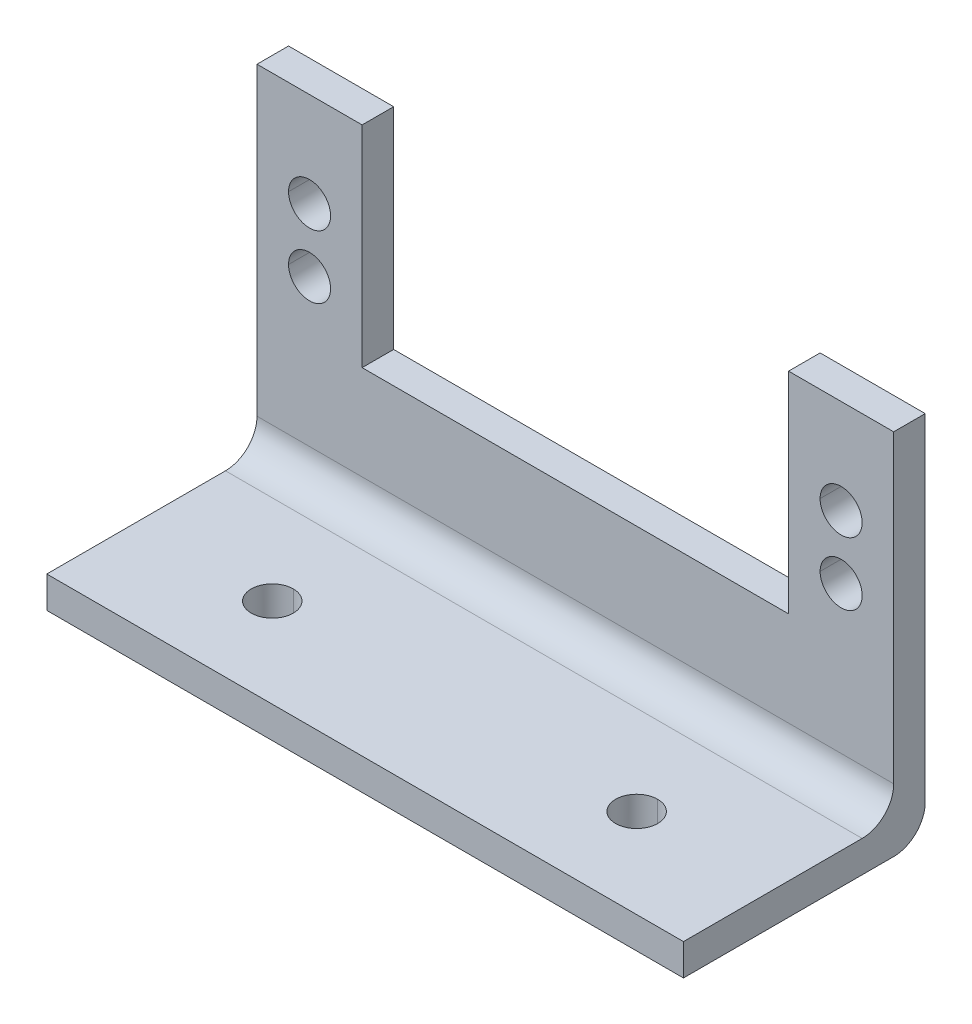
ISO-10303-21;
HEADER;
FILE_DESCRIPTION(('STEP AP214'),'2;1');
FILE_NAME('part.step','',(''),(''),'','','');
FILE_SCHEMA(('AUTOMOTIVE_DESIGN { 1 0 10303 214 1 1 1 1 }'));
ENDSEC;
DATA;
#1=APPLICATION_CONTEXT('core data for automotive mechanical design processes');
#2=APPLICATION_PROTOCOL_DEFINITION('international standard','automotive_design',2000,#1);
#3=PRODUCT_CONTEXT('',#1,'mechanical');
#4=PRODUCT('Part','Part','',(#3));
#5=PRODUCT_RELATED_PRODUCT_CATEGORY('part','',(#4));
#6=PRODUCT_DEFINITION_FORMATION('','',#4);
#7=PRODUCT_DEFINITION_CONTEXT('part definition',#1,'design');
#8=PRODUCT_DEFINITION('design','',#6,#7);
#9=PRODUCT_DEFINITION_SHAPE('','',#8);
#10=(LENGTH_UNIT() NAMED_UNIT(*) SI_UNIT(.MILLI.,.METRE.));
#11=(NAMED_UNIT(*) PLANE_ANGLE_UNIT() SI_UNIT($,.RADIAN.));
#12=(NAMED_UNIT(*) SI_UNIT($,.STERADIAN.) SOLID_ANGLE_UNIT());
#13=UNCERTAINTY_MEASURE_WITH_UNIT(LENGTH_MEASURE(1.E-05),#10,'distance_accuracy_value','');
#14=(GEOMETRIC_REPRESENTATION_CONTEXT(3) GLOBAL_UNCERTAINTY_ASSIGNED_CONTEXT((#13)) GLOBAL_UNIT_ASSIGNED_CONTEXT((#10,
#11,#12)) REPRESENTATION_CONTEXT('',''));
#15=CARTESIAN_POINT('',(0.,0.,0.));
#16=DIRECTION('',(0.,0.,1.));
#17=DIRECTION('',(1.,0.,0.));
#18=AXIS2_PLACEMENT_3D('',#15,#16,#17);
#19=CARTESIAN_POINT('',(30.285,-15.1838385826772,3.));
#20=DIRECTION('',(0.,0.,1.));
#21=DIRECTION('',(0.,1.,0.));
#22=AXIS2_PLACEMENT_3D('',#19,#20,#21);
#23=PLANE('',#22);
#24=CARTESIAN_POINT('',(-30.285,13.8161614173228,3.));
#25=DIRECTION('',(0.,-1.,0.));
#26=VECTOR('',#25,1.);
#27=LINE('',#24,#26);
#28=CARTESIAN_POINT('',(-30.285,13.8161614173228,3.));
#29=VERTEX_POINT('',#28);
#30=CARTESIAN_POINT('',(-30.285,-15.1838385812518,3.00003489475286));
#31=VERTEX_POINT('',#30);
#32=EDGE_CURVE('E11',#29,#31,#27,.T.);
#33=ORIENTED_EDGE('',*,*,#32,.T.);
#34=CARTESIAN_POINT('',(-30.285,-15.1838385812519,3.));
#35=DIRECTION('',(1.,-2.35320093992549E-11,0.));
#36=VECTOR('',#35,1.);
#37=LINE('',#34,#36);
#38=CARTESIAN_POINT('',(30.285,-15.1838385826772,3.));
#39=VERTEX_POINT('',#38);
#40=EDGE_CURVE('E24',#31,#39,#37,.T.);
#41=ORIENTED_EDGE('',*,*,#40,.T.);
#42=CARTESIAN_POINT('',(30.285,-15.1838385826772,3.));
#43=DIRECTION('',(0.,1.,0.));
#44=VECTOR('',#43,1.);
#45=LINE('',#42,#44);
#46=CARTESIAN_POINT('',(30.285,13.8161614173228,3.));
#47=VERTEX_POINT('',#46);
#48=EDGE_CURVE('E787',#39,#47,#45,.T.);
#49=ORIENTED_EDGE('',*,*,#48,.T.);
#50=CARTESIAN_POINT('',(30.285,13.8161614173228,3.));
#51=DIRECTION('',(-1.,0.,0.));
#52=VECTOR('',#51,1.);
#53=LINE('',#50,#52);
#54=CARTESIAN_POINT('',(20.285,13.8161614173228,3.));
#55=VERTEX_POINT('',#54);
#56=EDGE_CURVE('E785',#47,#55,#53,.T.);
#57=ORIENTED_EDGE('',*,*,#56,.T.);
#58=CARTESIAN_POINT('',(20.285,13.8161614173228,3.));
#59=DIRECTION('',(0.,-1.,0.));
#60=VECTOR('',#59,1.);
#61=LINE('',#58,#60);
#62=CARTESIAN_POINT('',(20.285,-6.18383858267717,3.));
#63=VERTEX_POINT('',#62);
#64=EDGE_CURVE('E782',#55,#63,#61,.T.);
#65=ORIENTED_EDGE('',*,*,#64,.T.);
#66=CARTESIAN_POINT('',(20.285,-6.18383858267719,3.));
#67=DIRECTION('',(-1.,0.,0.));
#68=VECTOR('',#67,1.);
#69=LINE('',#66,#68);
#70=CARTESIAN_POINT('',(-20.285,-6.18383858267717,3.));
#71=VERTEX_POINT('',#70);
#72=EDGE_CURVE('E779',#63,#71,#69,.T.);
#73=ORIENTED_EDGE('',*,*,#72,.T.);
#74=CARTESIAN_POINT('',(-20.285,-6.18383858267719,3.));
#75=DIRECTION('',(0.,1.,0.));
#76=VECTOR('',#75,1.);
#77=LINE('',#74,#76);
#78=CARTESIAN_POINT('',(-20.285,13.8161614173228,3.));
#79=VERTEX_POINT('',#78);
#80=EDGE_CURVE('E776',#71,#79,#77,.T.);
#81=ORIENTED_EDGE('',*,*,#80,.T.);
#82=CARTESIAN_POINT('',(-20.285,13.8161614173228,3.));
#83=DIRECTION('',(-1.,0.,0.));
#84=VECTOR('',#83,1.);
#85=LINE('',#82,#84);
#86=EDGE_CURVE('E774',#79,#29,#85,.T.);
#87=ORIENTED_EDGE('',*,*,#86,.T.);
#88=EDGE_LOOP('',(#33,#41,#49,#57,#65,#73,#81,#87));
#89=FACE_BOUND('',#88,.T.);
#90=CARTESIAN_POINT('',(23.285,-1.1838385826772,3.));
#91=CARTESIAN_POINT('',(23.2851480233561,-0.819505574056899,3.));
#92=CARTESIAN_POINT('',(23.3842661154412,-0.4626266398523,3.));
#93=CARTESIAN_POINT('',(23.75127060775,0.145497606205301,3.));
#94=CARTESIAN_POINT('',(24.0054590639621,0.3952907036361,3.));
#95=CARTESIAN_POINT('',(24.5245399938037,0.680251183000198,3.));
#96=CARTESIAN_POINT('',(24.7437456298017,0.7553024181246,3.));
#97=CARTESIAN_POINT('',(25.2009690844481,0.827919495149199,3.));
#98=CARTESIAN_POINT('',(25.4359413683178,0.824021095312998,3.));
#99=CARTESIAN_POINT('',(25.9435341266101,0.725972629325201,3.));
#100=CARTESIAN_POINT('',(26.2023540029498,0.614795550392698,3.));
#101=CARTESIAN_POINT('',(26.7379012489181,0.241071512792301,3.));
#102=CARTESIAN_POINT('',(26.9767962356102,-0.0543963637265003,3.));
#103=CARTESIAN_POINT('',(27.2299831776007,-0.644718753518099,3.));
#104=CARTESIAN_POINT('',(27.2848898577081,-0.9127430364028,3.));
#105=CARTESIAN_POINT('',(27.285,-1.1838385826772,3.));
#106=B_SPLINE_CURVE_WITH_KNOTS('',3,(#90,#91,#92,#93,#94,#95,#96,#97,#98,#99,#100,#101,#102,
#103,#104,#105),.UNSPECIFIED.,.F.,.F.,(4,2,2,2,2,2,2,4),(0.,0.176652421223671,0.344347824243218,
0.450905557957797,0.55872873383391,0.69031520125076,0.869269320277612,1.),.UNSPECIFIED.);
#107=CARTESIAN_POINT('',(23.285,-1.18383858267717,3.));
#108=VERTEX_POINT('',#107);
#109=CARTESIAN_POINT('',(27.285,-1.18383858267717,3.));
#110=VERTEX_POINT('',#109);
#111=EDGE_CURVE('E771',#108,#110,#106,.T.);
#112=ORIENTED_EDGE('',*,*,#111,.T.);
#113=CARTESIAN_POINT('',(27.285,-1.1838385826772,3.));
#114=CARTESIAN_POINT('',(27.2848519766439,-1.5481715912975,3.));
#115=CARTESIAN_POINT('',(27.1857338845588,-1.905050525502,3.));
#116=CARTESIAN_POINT('',(26.81872939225,-2.5131747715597,3.));
#117=CARTESIAN_POINT('',(26.5645409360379,-2.7629678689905,3.));
#118=CARTESIAN_POINT('',(26.0454600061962,-3.0479283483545,3.));
#119=CARTESIAN_POINT('',(25.8262543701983,-3.1229795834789,3.));
#120=CARTESIAN_POINT('',(25.3690309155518,-3.1955966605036,3.));
#121=CARTESIAN_POINT('',(25.1340586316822,-3.1916982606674,3.));
#122=CARTESIAN_POINT('',(24.6264658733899,-3.0936497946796,3.));
#123=CARTESIAN_POINT('',(24.3676459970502,-2.9824727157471,3.));
#124=CARTESIAN_POINT('',(23.8320987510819,-2.6087486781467,3.));
#125=CARTESIAN_POINT('',(23.5932037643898,-2.3132808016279,3.));
#126=CARTESIAN_POINT('',(23.3400168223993,-1.7229584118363,3.));
#127=CARTESIAN_POINT('',(23.2851101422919,-1.4549341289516,3.));
#128=CARTESIAN_POINT('',(23.285,-1.1838385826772,3.));
#129=B_SPLINE_CURVE_WITH_KNOTS('',3,(#113,#114,#115,#116,#117,#118,#119,#120,#121,#122,#123,
#124,#125,#126,#127,#128),.UNSPECIFIED.,.F.,.F.,(4,2,2,2,2,2,2,4),(0.,0.176652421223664,
0.344347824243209,0.450905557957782,0.558728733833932,0.690315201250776,0.869269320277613,1.),.UNSPECIFIED.);
#130=EDGE_CURVE('E769',#110,#108,#129,.T.);
#131=ORIENTED_EDGE('',*,*,#130,.T.);
#132=EDGE_LOOP('',(#112,#131));
#133=FACE_BOUND('',#132,.T.);
#134=CARTESIAN_POINT('',(23.285,4.8161614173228,3.));
#135=CARTESIAN_POINT('',(23.2851480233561,5.1804944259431,3.));
#136=CARTESIAN_POINT('',(23.3842661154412,5.5373733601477,3.));
#137=CARTESIAN_POINT('',(23.75127060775,6.1454976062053,3.));
#138=CARTESIAN_POINT('',(24.0054590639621,6.3952907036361,3.));
#139=CARTESIAN_POINT('',(24.5245399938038,6.6802511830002,3.));
#140=CARTESIAN_POINT('',(24.7437456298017,6.7553024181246,3.));
#141=CARTESIAN_POINT('',(25.2009690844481,6.8279194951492,3.));
#142=CARTESIAN_POINT('',(25.4359413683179,6.824021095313,3.));
#143=CARTESIAN_POINT('',(25.9435341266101,6.7259726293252,3.));
#144=CARTESIAN_POINT('',(26.2023540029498,6.6147955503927,3.));
#145=CARTESIAN_POINT('',(26.7379012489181,6.2410715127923,3.));
#146=CARTESIAN_POINT('',(26.9767962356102,5.9456036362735,3.));
#147=CARTESIAN_POINT('',(27.2299831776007,5.3552812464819,3.));
#148=CARTESIAN_POINT('',(27.2848898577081,5.0872569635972,3.));
#149=CARTESIAN_POINT('',(27.285,4.8161614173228,3.));
#150=B_SPLINE_CURVE_WITH_KNOTS('',3,(#134,#135,#136,#137,#138,#139,#140,#141,#142,#143,#144,
#145,#146,#147,#148,#149),.UNSPECIFIED.,.F.,.F.,(4,2,2,2,2,2,2,4),(0.,0.17665242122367,
0.344347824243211,0.450905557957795,0.558728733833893,0.690315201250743,0.869269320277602,1.),.UNSPECIFIED.);
#151=CARTESIAN_POINT('',(23.285,4.81616141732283,3.));
#152=VERTEX_POINT('',#151);
#153=CARTESIAN_POINT('',(27.285,4.81616141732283,3.));
#154=VERTEX_POINT('',#153);
#155=EDGE_CURVE('E766',#152,#154,#150,.T.);
#156=ORIENTED_EDGE('',*,*,#155,.T.);
#157=CARTESIAN_POINT('',(27.285,4.8161614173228,3.));
#158=CARTESIAN_POINT('',(27.2848519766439,4.4518284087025,3.));
#159=CARTESIAN_POINT('',(27.1857338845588,4.094949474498,3.));
#160=CARTESIAN_POINT('',(26.81872939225,3.4868252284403,3.));
#161=CARTESIAN_POINT('',(26.5645409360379,3.2370321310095,3.));
#162=CARTESIAN_POINT('',(26.0454600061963,2.9520716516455,3.));
#163=CARTESIAN_POINT('',(25.8262543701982,2.8770204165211,3.));
#164=CARTESIAN_POINT('',(25.3690309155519,2.8044033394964,3.));
#165=CARTESIAN_POINT('',(25.1340586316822,2.8083017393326,3.));
#166=CARTESIAN_POINT('',(24.6264658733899,2.9063502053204,3.));
#167=CARTESIAN_POINT('',(24.3676459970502,3.0175272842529,3.));
#168=CARTESIAN_POINT('',(23.8320987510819,3.3912513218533,3.));
#169=CARTESIAN_POINT('',(23.5932037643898,3.6867191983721,3.));
#170=CARTESIAN_POINT('',(23.3400168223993,4.2770415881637,3.));
#171=CARTESIAN_POINT('',(23.2851101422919,4.5450658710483,3.));
#172=CARTESIAN_POINT('',(23.285,4.8161614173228,3.));
#173=B_SPLINE_CURVE_WITH_KNOTS('',3,(#157,#158,#159,#160,#161,#162,#163,#164,#165,#166,#167,
#168,#169,#170,#171,#172),.UNSPECIFIED.,.F.,.F.,(4,2,2,2,2,2,2,4),(0.,0.176652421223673,
0.344347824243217,0.450905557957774,0.558728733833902,0.690315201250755,0.869269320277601,1.),.UNSPECIFIED.);
#174=EDGE_CURVE('E764',#154,#152,#173,.T.);
#175=ORIENTED_EDGE('',*,*,#174,.T.);
#176=EDGE_LOOP('',(#156,#175));
#177=FACE_BOUND('',#176,.T.);
#178=CARTESIAN_POINT('',(-25.285,-1.18383858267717,3.));
#179=DIRECTION('',(0.,0.,1.));
#180=DIRECTION('',(1.,0.,0.));
#181=AXIS2_PLACEMENT_3D('',#178,#179,#180);
#182=CIRCLE('',#181,2.);
#183=CARTESIAN_POINT('',(-23.285,-1.18383858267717,3.));
#184=VERTEX_POINT('',#183);
#185=CARTESIAN_POINT('',(-27.2850001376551,-1.18383858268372,3.));
#186=VERTEX_POINT('',#185);
#187=EDGE_CURVE('E762',#184,#186,#182,.T.);
#188=ORIENTED_EDGE('',*,*,#187,.F.);
#189=CARTESIAN_POINT('',(-25.285,-1.18383858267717,3.));
#190=DIRECTION('',(0.,0.,1.));
#191=DIRECTION('',(-1.,-3.27374845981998E-12,0.));
#192=AXIS2_PLACEMENT_3D('',#189,#190,#191);
#193=CIRCLE('',#192,2.);
#194=EDGE_CURVE('E760',#186,#184,#193,.T.);
#195=ORIENTED_EDGE('',*,*,#194,.F.);
#196=EDGE_LOOP('',(#188,#195));
#197=FACE_BOUND('',#196,.T.);
#198=CARTESIAN_POINT('',(-25.285,4.81616141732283,3.));
#199=DIRECTION('',(0.,0.,1.));
#200=DIRECTION('',(1.,0.,0.));
#201=AXIS2_PLACEMENT_3D('',#198,#199,#200);
#202=CIRCLE('',#201,2.);
#203=CARTESIAN_POINT('',(-23.285,4.81616141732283,3.));
#204=VERTEX_POINT('',#203);
#205=CARTESIAN_POINT('',(-27.2850001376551,4.81616141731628,3.));
#206=VERTEX_POINT('',#205);
#207=EDGE_CURVE('E758',#204,#206,#202,.T.);
#208=ORIENTED_EDGE('',*,*,#207,.F.);
#209=CARTESIAN_POINT('',(-25.285,4.81616141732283,3.));
#210=DIRECTION('',(0.,0.,1.));
#211=DIRECTION('',(-1.,-3.27385688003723E-12,0.));
#212=AXIS2_PLACEMENT_3D('',#209,#210,#211);
#213=CIRCLE('',#212,2.);
#214=EDGE_CURVE('E755',#206,#204,#213,.T.);
#215=ORIENTED_EDGE('',*,*,#214,.F.);
#216=EDGE_LOOP('',(#208,#215));
#217=FACE_BOUND('',#216,.T.);
#218=ADVANCED_FACE('F16',(#89,#133,#177,#197,#217),#23,.T.);
#219=CARTESIAN_POINT('',(-25.285,4.81616141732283,0.));
#220=DIRECTION('',(0.,0.,1.));
#221=DIRECTION('',(0.,1.,0.));
#222=AXIS2_PLACEMENT_3D('',#219,#220,#221);
#223=CYLINDRICAL_SURFACE('',#222,2.);
#224=ORIENTED_EDGE('',*,*,#214,.T.);
#225=CARTESIAN_POINT('',(-23.285,4.81616141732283,0.));
#226=DIRECTION('',(0.,0.,1.));
#227=VECTOR('',#226,1.);
#228=LINE('',#225,#227);
#229=CARTESIAN_POINT('',(-23.285,4.81616141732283,0.));
#230=VERTEX_POINT('',#229);
#231=EDGE_CURVE('E752',#230,#204,#228,.T.);
#232=ORIENTED_EDGE('',*,*,#231,.F.);
#233=CARTESIAN_POINT('',(-25.285,4.81616141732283,0.));
#234=DIRECTION('',(0.,0.,-1.));
#235=DIRECTION('',(1.,0.,0.));
#236=AXIS2_PLACEMENT_3D('',#233,#234,#235);
#237=CIRCLE('',#236,2.);
#238=CARTESIAN_POINT('',(-27.285,4.81616141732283,0.));
#239=VERTEX_POINT('',#238);
#240=EDGE_CURVE('E748',#230,#239,#237,.T.);
#241=ORIENTED_EDGE('',*,*,#240,.T.);
#242=CARTESIAN_POINT('',(-27.285,4.81616141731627,3.));
#243=DIRECTION('',(0.,2.18661894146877E-12,-1.));
#244=VECTOR('',#243,1.);
#245=LINE('',#242,#244);
#246=EDGE_CURVE('E741',#206,#239,#245,.T.);
#247=ORIENTED_EDGE('',*,*,#246,.F.);
#248=EDGE_LOOP('',(#224,#232,#241,#247));
#249=FACE_BOUND('',#248,.T.);
#250=ADVANCED_FACE('F1246',(#249),#223,.F.);
#251=CARTESIAN_POINT('',(-25.285,4.81616141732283,0.));
#252=DIRECTION('',(0.,0.,1.));
#253=DIRECTION('',(1.63786223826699E-12,-1.,0.));
#254=AXIS2_PLACEMENT_3D('',#251,#252,#253);
#255=CYLINDRICAL_SURFACE('',#254,2.);
#256=CARTESIAN_POINT('',(-25.285,4.81616141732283,0.));
#257=DIRECTION('',(0.,0.,-1.));
#258=DIRECTION('',(-1.,0.,0.));
#259=AXIS2_PLACEMENT_3D('',#256,#257,#258);
#260=CIRCLE('',#259,2.);
#261=EDGE_CURVE('E738',#239,#230,#260,.T.);
#262=ORIENTED_EDGE('',*,*,#261,.T.);
#263=ORIENTED_EDGE('',*,*,#231,.T.);
#264=ORIENTED_EDGE('',*,*,#207,.T.);
#265=ORIENTED_EDGE('',*,*,#246,.T.);
#266=EDGE_LOOP('',(#262,#263,#264,#265));
#267=FACE_BOUND('',#266,.T.);
#268=ADVANCED_FACE('F1238',(#267),#255,.F.);
#269=CARTESIAN_POINT('',(30.285,-18.1838385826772,0.));
#270=DIRECTION('',(0.,0.,-1.));
#271=DIRECTION('',(-1.,0.,0.));
#272=AXIS2_PLACEMENT_3D('',#269,#270,#271);
#273=PLANE('',#272);
#274=CARTESIAN_POINT('',(30.285,-18.1838385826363,1.19221160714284E-06));
#275=DIRECTION('',(0.,0.999999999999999,-3.7256612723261E-08));
#276=VECTOR('',#275,1.);
#277=LINE('',#274,#276);
#278=CARTESIAN_POINT('',(30.285,-18.1838385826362,1.19221160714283E-06));
#279=VERTEX_POINT('',#278);
#280=CARTESIAN_POINT('',(30.285,13.8161614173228,0.));
#281=VERTEX_POINT('',#280);
#282=EDGE_CURVE('E735',#279,#281,#277,.T.);
#283=ORIENTED_EDGE('',*,*,#282,.F.);
#284=CARTESIAN_POINT('',(30.285,-18.1838385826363,0.));
#285=DIRECTION('',(-1.,1.48426113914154E-11,0.));
#286=VECTOR('',#285,1.);
#287=LINE('',#284,#286);
#288=CARTESIAN_POINT('',(-30.285,-18.1838385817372,3.54016001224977E-05));
#289=VERTEX_POINT('',#288);
#290=EDGE_CURVE('E259',#279,#289,#287,.T.);
#291=ORIENTED_EDGE('',*,*,#290,.T.);
#292=CARTESIAN_POINT('',(-30.285,13.8161614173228,0.));
#293=DIRECTION('',(0.,-0.999999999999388,1.10630000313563E-06));
#294=VECTOR('',#293,1.);
#295=LINE('',#292,#294);
#296=CARTESIAN_POINT('',(-30.285,13.8161614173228,0.));
#297=VERTEX_POINT('',#296);
#298=EDGE_CURVE('E292',#297,#289,#295,.T.);
#299=ORIENTED_EDGE('',*,*,#298,.F.);
#300=CARTESIAN_POINT('',(-20.285,13.8161614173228,0.));
#301=DIRECTION('',(-1.,0.,0.));
#302=VECTOR('',#301,1.);
#303=LINE('',#300,#302);
#304=CARTESIAN_POINT('',(-20.285,13.8161614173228,0.));
#305=VERTEX_POINT('',#304);
#306=EDGE_CURVE('E726',#305,#297,#303,.T.);
#307=ORIENTED_EDGE('',*,*,#306,.F.);
#308=CARTESIAN_POINT('',(-20.285,-6.18383858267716,0.));
#309=DIRECTION('',(0.,1.,0.));
#310=VECTOR('',#309,1.);
#311=LINE('',#308,#310);
#312=CARTESIAN_POINT('',(-20.285,-6.18383858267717,0.));
#313=VERTEX_POINT('',#312);
#314=EDGE_CURVE('E720',#313,#305,#311,.T.);
#315=ORIENTED_EDGE('',*,*,#314,.F.);
#316=CARTESIAN_POINT('',(20.285,-6.18383858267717,0.));
#317=DIRECTION('',(-1.,0.,0.));
#318=VECTOR('',#317,1.);
#319=LINE('',#316,#318);
#320=CARTESIAN_POINT('',(20.285,-6.18383858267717,0.));
#321=VERTEX_POINT('',#320);
#322=EDGE_CURVE('E716',#321,#313,#319,.T.);
#323=ORIENTED_EDGE('',*,*,#322,.F.);
#324=CARTESIAN_POINT('',(20.285,13.8161614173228,0.));
#325=DIRECTION('',(0.,-1.,0.));
#326=VECTOR('',#325,1.);
#327=LINE('',#324,#326);
#328=CARTESIAN_POINT('',(20.285,13.8161614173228,0.));
#329=VERTEX_POINT('',#328);
#330=EDGE_CURVE('E714',#329,#321,#327,.T.);
#331=ORIENTED_EDGE('',*,*,#330,.F.);
#332=CARTESIAN_POINT('',(30.285,13.8161614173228,0.));
#333=DIRECTION('',(-1.,0.,0.));
#334=VECTOR('',#333,1.);
#335=LINE('',#332,#334);
#336=EDGE_CURVE('E712',#281,#329,#335,.T.);
#337=ORIENTED_EDGE('',*,*,#336,.F.);
#338=EDGE_LOOP('',(#283,#291,#299,#307,#315,#323,#331,#337));
#339=FACE_BOUND('',#338,.T.);
#340=ORIENTED_EDGE('',*,*,#240,.F.);
#341=ORIENTED_EDGE('',*,*,#261,.F.);
#342=EDGE_LOOP('',(#340,#341));
#343=FACE_BOUND('',#342,.T.);
#344=CARTESIAN_POINT('',(23.285,-1.1838385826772,0.));
#345=CARTESIAN_POINT('',(23.2851480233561,-1.5481715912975,0.));
#346=CARTESIAN_POINT('',(23.3842661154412,-1.905050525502,0.));
#347=CARTESIAN_POINT('',(23.7540523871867,-2.5177841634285,0.));
#348=CARTESIAN_POINT('',(24.0121063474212,-2.7666170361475,0.));
#349=CARTESIAN_POINT('',(24.5245399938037,-3.0479283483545,0.));
#350=CARTESIAN_POINT('',(24.7437456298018,-3.1229795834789,0.));
#351=CARTESIAN_POINT('',(25.2473051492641,-3.2029558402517,0.));
#352=CARTESIAN_POINT('',(25.5301227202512,-3.1884180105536,0.));
#353=CARTESIAN_POINT('',(26.1319165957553,-3.0279433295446,0.));
#354=CARTESIAN_POINT('',(26.4267391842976,-2.8589677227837,0.));
#355=CARTESIAN_POINT('',(27.0617736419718,-2.2523926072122,0.));
#356=CARTESIAN_POINT('',(27.2847778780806,-1.7305519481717,0.));
#357=CARTESIAN_POINT('',(27.285,-1.1838385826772,0.));
#358=B_SPLINE_CURVE_WITH_KNOTS('',3,(#344,#345,#346,#347,#348,#349,#350,#351,#352,#353,#354,
#355,#356,#357),.UNSPECIFIED.,.F.,.F.,(4,2,2,2,2,2,4),(0.,0.171731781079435,0.33729338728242,
0.44474563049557,0.575382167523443,0.735626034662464,1.),.UNSPECIFIED.);
#359=CARTESIAN_POINT('',(23.285,-1.18383858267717,0.));
#360=VERTEX_POINT('',#359);
#361=CARTESIAN_POINT('',(27.285,-1.18383858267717,0.));
#362=VERTEX_POINT('',#361);
#363=EDGE_CURVE('E709',#360,#362,#358,.T.);
#364=ORIENTED_EDGE('',*,*,#363,.T.);
#365=CARTESIAN_POINT('',(27.285,-1.1838385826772,0.));
#366=CARTESIAN_POINT('',(27.2848519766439,-0.819505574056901,0.));
#367=CARTESIAN_POINT('',(27.1857338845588,-0.462626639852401,0.));
#368=CARTESIAN_POINT('',(26.8159476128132,0.1501069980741,0.));
#369=CARTESIAN_POINT('',(26.5578936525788,0.398939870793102,0.));
#370=CARTESIAN_POINT('',(26.0454600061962,0.680251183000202,0.));
#371=CARTESIAN_POINT('',(25.8262543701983,0.7553024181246,0.));
#372=CARTESIAN_POINT('',(25.3226948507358,0.8352786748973,0.));
#373=CARTESIAN_POINT('',(25.0398772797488,0.820740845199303,0.));
#374=CARTESIAN_POINT('',(24.4380834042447,0.660266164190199,0.));
#375=CARTESIAN_POINT('',(24.1432608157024,0.491290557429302,0.));
#376=CARTESIAN_POINT('',(23.5082263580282,-0.115284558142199,0.));
#377=CARTESIAN_POINT('',(23.2852221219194,-0.637125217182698,0.));
#378=CARTESIAN_POINT('',(23.285,-1.1838385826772,0.));
#379=B_SPLINE_CURVE_WITH_KNOTS('',3,(#365,#366,#367,#368,#369,#370,#371,#372,#373,#374,#375,
#376,#377,#378),.UNSPECIFIED.,.F.,.F.,(4,2,2,2,2,2,4),(0.,0.171731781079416,0.337293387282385,
0.444745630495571,0.575382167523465,0.735626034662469,1.),.UNSPECIFIED.);
#380=EDGE_CURVE('E707',#362,#360,#379,.T.);
#381=ORIENTED_EDGE('',*,*,#380,.T.);
#382=EDGE_LOOP('',(#364,#381));
#383=FACE_BOUND('',#382,.T.);
#384=CARTESIAN_POINT('',(23.285,4.8161614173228,0.));
#385=CARTESIAN_POINT('',(23.2851480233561,4.4518284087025,0.));
#386=CARTESIAN_POINT('',(23.3842661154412,4.094949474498,0.));
#387=CARTESIAN_POINT('',(23.7540523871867,3.4822158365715,0.));
#388=CARTESIAN_POINT('',(24.0121063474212,3.2333829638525,0.));
#389=CARTESIAN_POINT('',(24.5245399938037,2.9520716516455,0.));
#390=CARTESIAN_POINT('',(24.7437456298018,2.8770204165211,0.));
#391=CARTESIAN_POINT('',(25.2473051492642,2.7970441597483,0.));
#392=CARTESIAN_POINT('',(25.5301227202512,2.8115819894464,0.));
#393=CARTESIAN_POINT('',(26.1319165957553,2.9720566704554,0.));
#394=CARTESIAN_POINT('',(26.4267391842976,3.1410322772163,0.));
#395=CARTESIAN_POINT('',(27.0617736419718,3.7476073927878,0.));
#396=CARTESIAN_POINT('',(27.2847778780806,4.2694480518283,0.));
#397=CARTESIAN_POINT('',(27.285,4.8161614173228,0.));
#398=B_SPLINE_CURVE_WITH_KNOTS('',3,(#384,#385,#386,#387,#388,#389,#390,#391,#392,#393,#394,
#395,#396,#397),.UNSPECIFIED.,.F.,.F.,(4,2,2,2,2,2,4),(0.,0.17173178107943,0.337293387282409,
0.444745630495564,0.575382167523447,0.735626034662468,1.),.UNSPECIFIED.);
#399=CARTESIAN_POINT('',(23.285,4.81616141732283,0.));
#400=VERTEX_POINT('',#399);
#401=CARTESIAN_POINT('',(27.285,4.81616141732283,0.));
#402=VERTEX_POINT('',#401);
#403=EDGE_CURVE('E704',#400,#402,#398,.T.);
#404=ORIENTED_EDGE('',*,*,#403,.T.);
#405=CARTESIAN_POINT('',(27.285,4.8161614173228,0.));
#406=CARTESIAN_POINT('',(27.2848519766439,5.1804944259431,0.));
#407=CARTESIAN_POINT('',(27.1857338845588,5.5373733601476,0.));
#408=CARTESIAN_POINT('',(26.8159476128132,6.1501069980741,0.));
#409=CARTESIAN_POINT('',(26.5578936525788,6.3989398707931,0.));
#410=CARTESIAN_POINT('',(26.0454600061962,6.6802511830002,0.));
#411=CARTESIAN_POINT('',(25.8262543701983,6.7553024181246,0.));
#412=CARTESIAN_POINT('',(25.3226948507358,6.8352786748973,0.));
#413=CARTESIAN_POINT('',(25.0398772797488,6.8207408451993,0.));
#414=CARTESIAN_POINT('',(24.4380834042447,6.6602661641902,0.));
#415=CARTESIAN_POINT('',(24.1432608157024,6.4912905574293,0.));
#416=CARTESIAN_POINT('',(23.5082263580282,5.8847154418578,0.));
#417=CARTESIAN_POINT('',(23.2852221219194,5.3628747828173,0.));
#418=CARTESIAN_POINT('',(23.285,4.8161614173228,0.));
#419=B_SPLINE_CURVE_WITH_KNOTS('',3,(#405,#406,#407,#408,#409,#410,#411,#412,#413,#414,#415,
#416,#417,#418),.UNSPECIFIED.,.F.,.F.,(4,2,2,2,2,2,4),(0.,0.171731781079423,0.337293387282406,
0.444745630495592,0.575382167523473,0.735626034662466,1.),.UNSPECIFIED.);
#420=EDGE_CURVE('E701',#402,#400,#419,.T.);
#421=ORIENTED_EDGE('',*,*,#420,.T.);
#422=EDGE_LOOP('',(#404,#421));
#423=FACE_BOUND('',#422,.T.);
#424=CARTESIAN_POINT('',(-25.285,-1.18383858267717,0.));
#425=DIRECTION('',(0.,0.,-1.));
#426=DIRECTION('',(1.,0.,0.));
#427=AXIS2_PLACEMENT_3D('',#424,#425,#426);
#428=CIRCLE('',#427,2.);
#429=CARTESIAN_POINT('',(-23.285,-1.18383858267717,0.));
#430=VERTEX_POINT('',#429);
#431=CARTESIAN_POINT('',(-27.285,-1.18383858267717,0.));
#432=VERTEX_POINT('',#431);
#433=EDGE_CURVE('E699',#430,#432,#428,.T.);
#434=ORIENTED_EDGE('',*,*,#433,.F.);
#435=CARTESIAN_POINT('',(-25.285,-1.18383858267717,0.));
#436=DIRECTION('',(0.,0.,-1.));
#437=DIRECTION('',(-1.,0.,0.));
#438=AXIS2_PLACEMENT_3D('',#435,#436,#437);
#439=CIRCLE('',#438,2.);
#440=EDGE_CURVE('E695',#432,#430,#439,.T.);
#441=ORIENTED_EDGE('',*,*,#440,.F.);
#442=EDGE_LOOP('',(#434,#441));
#443=FACE_BOUND('',#442,.T.);
#444=ADVANCED_FACE('F1064',(#339,#343,#383,#423,#443),#273,.T.);
#445=CARTESIAN_POINT('',(-25.285,-1.18383858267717,0.));
#446=DIRECTION('',(0.,0.,1.));
#447=DIRECTION('',(1.63786223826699E-12,-1.,0.));
#448=AXIS2_PLACEMENT_3D('',#445,#446,#447);
#449=CYLINDRICAL_SURFACE('',#448,2.);
#450=ORIENTED_EDGE('',*,*,#440,.T.);
#451=CARTESIAN_POINT('',(-23.285,-1.18383858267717,0.));
#452=DIRECTION('',(0.,0.,1.));
#453=VECTOR('',#452,1.);
#454=LINE('',#451,#453);
#455=EDGE_CURVE('E687',#430,#184,#454,.T.);
#456=ORIENTED_EDGE('',*,*,#455,.T.);
#457=ORIENTED_EDGE('',*,*,#187,.T.);
#458=CARTESIAN_POINT('',(-27.285,-1.18383858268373,3.));
#459=DIRECTION('',(0.,2.18676350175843E-12,-1.));
#460=VECTOR('',#459,1.);
#461=LINE('',#458,#460);
#462=EDGE_CURVE('E682',#186,#432,#461,.T.);
#463=ORIENTED_EDGE('',*,*,#462,.T.);
#464=EDGE_LOOP('',(#450,#456,#457,#463));
#465=FACE_BOUND('',#464,.T.);
#466=ADVANCED_FACE('F1055',(#465),#449,.F.);
#467=CARTESIAN_POINT('',(-25.285,-1.18383858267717,0.));
#468=DIRECTION('',(0.,0.,1.));
#469=DIRECTION('',(0.,1.,0.));
#470=AXIS2_PLACEMENT_3D('',#467,#468,#469);
#471=CYLINDRICAL_SURFACE('',#470,2.);
#472=ORIENTED_EDGE('',*,*,#194,.T.);
#473=ORIENTED_EDGE('',*,*,#455,.F.);
#474=ORIENTED_EDGE('',*,*,#433,.T.);
#475=ORIENTED_EDGE('',*,*,#462,.F.);
#476=EDGE_LOOP('',(#472,#473,#474,#475));
#477=FACE_BOUND('',#476,.T.);
#478=ADVANCED_FACE('F991',(#477),#471,.F.);
#479=CARTESIAN_POINT('',(25.285,4.81616141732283,0.));
#480=DIRECTION('',(0.,0.,1.));
#481=DIRECTION('',(0.,-1.,0.));
#482=AXIS2_PLACEMENT_3D('',#479,#480,#481);
#483=CYLINDRICAL_SURFACE('',#482,2.);
#484=ORIENTED_EDGE('',*,*,#420,.F.);
#485=CARTESIAN_POINT('',(27.285,4.81616141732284,0.));
#486=DIRECTION('',(0.,0.,1.));
#487=VECTOR('',#486,1.);
#488=LINE('',#485,#487);
#489=EDGE_CURVE('E674',#402,#154,#488,.T.);
#490=ORIENTED_EDGE('',*,*,#489,.T.);
#491=ORIENTED_EDGE('',*,*,#155,.F.);
#492=CARTESIAN_POINT('',(23.285,4.81616141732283,3.));
#493=DIRECTION('',(0.,0.,-1.));
#494=VECTOR('',#493,1.);
#495=LINE('',#492,#494);
#496=EDGE_CURVE('E669',#152,#400,#495,.T.);
#497=ORIENTED_EDGE('',*,*,#496,.T.);
#498=EDGE_LOOP('',(#484,#490,#491,#497));
#499=FACE_BOUND('',#498,.T.);
#500=ADVANCED_FACE('F982',(#499),#483,.F.);
#501=CARTESIAN_POINT('',(25.285,4.81616141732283,0.));
#502=DIRECTION('',(0.,0.,1.));
#503=DIRECTION('',(0.,1.,0.));
#504=AXIS2_PLACEMENT_3D('',#501,#502,#503);
#505=CYLINDRICAL_SURFACE('',#504,2.);
#506=ORIENTED_EDGE('',*,*,#174,.F.);
#507=ORIENTED_EDGE('',*,*,#489,.F.);
#508=ORIENTED_EDGE('',*,*,#403,.F.);
#509=ORIENTED_EDGE('',*,*,#496,.F.);
#510=EDGE_LOOP('',(#506,#507,#508,#509));
#511=FACE_BOUND('',#510,.T.);
#512=ADVANCED_FACE('F915',(#511),#505,.F.);
#513=CARTESIAN_POINT('',(25.285,-1.18383858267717,0.));
#514=DIRECTION('',(0.,0.,1.));
#515=DIRECTION('',(0.,-1.,0.));
#516=AXIS2_PLACEMENT_3D('',#513,#514,#515);
#517=CYLINDRICAL_SURFACE('',#516,2.);
#518=ORIENTED_EDGE('',*,*,#380,.F.);
#519=CARTESIAN_POINT('',(27.285,-1.18383858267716,0.));
#520=DIRECTION('',(0.,0.,1.));
#521=VECTOR('',#520,1.);
#522=LINE('',#519,#521);
#523=EDGE_CURVE('E661',#362,#110,#522,.T.);
#524=ORIENTED_EDGE('',*,*,#523,.T.);
#525=ORIENTED_EDGE('',*,*,#111,.F.);
#526=CARTESIAN_POINT('',(23.285,-1.18383858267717,3.));
#527=DIRECTION('',(0.,0.,-1.));
#528=VECTOR('',#527,1.);
#529=LINE('',#526,#528);
#530=EDGE_CURVE('E654',#108,#360,#529,.T.);
#531=ORIENTED_EDGE('',*,*,#530,.T.);
#532=EDGE_LOOP('',(#518,#524,#525,#531));
#533=FACE_BOUND('',#532,.T.);
#534=ADVANCED_FACE('F906',(#533),#517,.F.);
#535=CARTESIAN_POINT('',(25.285,-1.18383858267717,0.));
#536=DIRECTION('',(0.,0.,1.));
#537=DIRECTION('',(0.,1.,0.));
#538=AXIS2_PLACEMENT_3D('',#535,#536,#537);
#539=CYLINDRICAL_SURFACE('',#538,2.);
#540=ORIENTED_EDGE('',*,*,#130,.F.);
#541=ORIENTED_EDGE('',*,*,#523,.F.);
#542=ORIENTED_EDGE('',*,*,#363,.F.);
#543=ORIENTED_EDGE('',*,*,#530,.F.);
#544=EDGE_LOOP('',(#540,#541,#542,#543));
#545=FACE_BOUND('',#544,.T.);
#546=ADVANCED_FACE('F837',(#545),#539,.F.);
#547=CARTESIAN_POINT('',(20.285,13.8161614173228,3.));
#548=DIRECTION('',(0.,1.,0.));
#549=DIRECTION('',(1.,0.,0.));
#550=AXIS2_PLACEMENT_3D('',#547,#548,#549);
#551=PLANE('',#550);
#552=ORIENTED_EDGE('',*,*,#336,.T.);
#553=CARTESIAN_POINT('',(20.285,13.8161614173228,3.));
#554=DIRECTION('',(0.,0.,-1.));
#555=VECTOR('',#554,1.);
#556=LINE('',#553,#555);
#557=EDGE_CURVE('E647',#55,#329,#556,.T.);
#558=ORIENTED_EDGE('',*,*,#557,.F.);
#559=ORIENTED_EDGE('',*,*,#56,.F.);
#560=CARTESIAN_POINT('',(30.285,13.8161614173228,3.));
#561=DIRECTION('',(0.,0.,-1.));
#562=VECTOR('',#561,1.);
#563=LINE('',#560,#562);
#564=EDGE_CURVE('E644',#47,#281,#563,.T.);
#565=ORIENTED_EDGE('',*,*,#564,.T.);
#566=EDGE_LOOP('',(#552,#558,#559,#565));
#567=FACE_BOUND('',#566,.T.);
#568=ADVANCED_FACE('F794',(#567),#551,.T.);
#569=CARTESIAN_POINT('',(30.285,13.8161614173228,-2.3844232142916E-06));
#570=DIRECTION('',(1.,0.,0.));
#571=DIRECTION('',(0.,0.,1.));
#572=AXIS2_PLACEMENT_3D('',#569,#570,#571);
#573=PLANE('',#572);
#574=CARTESIAN_POINT('',(30.285,-21.1838385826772,23.));
#575=DIRECTION('',(0.,1.31731700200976E-07,-0.999999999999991));
#576=VECTOR('',#575,1.);
#577=LINE('',#574,#576);
#578=CARTESIAN_POINT('',(30.285,-21.1838385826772,23.));
#579=VERTEX_POINT('',#578);
#580=CARTESIAN_POINT('',(30.285,-21.1838359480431,3.00000000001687));
#581=VERTEX_POINT('',#580);
#582=EDGE_CURVE('E366',#579,#581,#577,.T.);
#583=ORIENTED_EDGE('',*,*,#582,.T.);
#584=CARTESIAN_POINT('',(30.285,-21.1838359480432,3.00000000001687));
#585=CARTESIAN_POINT('',(30.285,-21.183833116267,2.20434197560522));
#586=CARTESIAN_POINT('',(30.285,-20.8677816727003,1.44129621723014));
#587=CARTESIAN_POINT('',(30.285,-19.9823755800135,0.55589127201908));
#588=CARTESIAN_POINT('',(30.285,-19.5902064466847,0.311038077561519));
#589=CARTESIAN_POINT('',(30.285,-18.844812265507,0.0549815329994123));
#590=CARTESIAN_POINT('',(30.285,-18.5154978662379,1.53559429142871E-06));
#591=CARTESIAN_POINT('',(30.285,-18.1838385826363,1.19221160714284E-06));
#592=B_SPLINE_CURVE_WITH_KNOTS('',3,(#584,#585,#586,#587,#588,#589,#590,#591),.UNSPECIFIED.,.F.,
.F.,(4,2,2,4),(0.,0.502371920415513,0.790593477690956,1.),.UNSPECIFIED.);
#593=EDGE_CURVE('E270',#581,#279,#592,.T.);
#594=ORIENTED_EDGE('',*,*,#593,.T.);
#595=ORIENTED_EDGE('',*,*,#282,.T.);
#596=ORIENTED_EDGE('',*,*,#564,.F.);
#597=ORIENTED_EDGE('',*,*,#48,.F.);
#598=CARTESIAN_POINT('',(30.285,-15.1838385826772,3.));
#599=CARTESIAN_POINT('',(30.285,-15.6551969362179,3.00001781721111));
#600=CARTESIAN_POINT('',(30.285,-16.1194652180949,3.11074768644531));
#601=CARTESIAN_POINT('',(30.285,-17.1134338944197,3.6145325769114));
#602=CARTESIAN_POINT('',(30.285,-17.5786558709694,4.0820229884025));
#603=CARTESIAN_POINT('',(30.285,-18.0753854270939,5.07402536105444));
#604=CARTESIAN_POINT('',(30.285,-18.1838116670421,5.53357754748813));
#605=CARTESIAN_POINT('',(30.285,-18.1838385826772,6.));
#606=B_SPLINE_CURVE_WITH_KNOTS('',3,(#598,#599,#600,#601,#602,#603,#604,#605),.UNSPECIFIED.,.F.,
.F.,(4,2,2,4),(0.,0.298212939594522,0.704913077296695,1.),.UNSPECIFIED.);
#607=CARTESIAN_POINT('',(30.285,-18.1838385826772,6.));
#608=VERTEX_POINT('',#607);
#609=EDGE_CURVE('E639',#39,#608,#606,.T.);
#610=ORIENTED_EDGE('',*,*,#609,.T.);
#611=CARTESIAN_POINT('',(30.285,-18.1838385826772,23.));
#612=DIRECTION('',(0.,0.,-1.));
#613=VECTOR('',#612,1.);
#614=LINE('',#611,#613);
#615=CARTESIAN_POINT('',(30.285,-18.1838385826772,23.));
#616=VERTEX_POINT('',#615);
#617=EDGE_CURVE('E598',#616,#608,#614,.T.);
#618=ORIENTED_EDGE('',*,*,#617,.F.);
#619=CARTESIAN_POINT('',(30.285,-21.1838385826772,23.));
#620=DIRECTION('',(0.,1.,0.));
#621=VECTOR('',#620,1.);
#622=LINE('',#619,#621);
#623=EDGE_CURVE('E423',#579,#616,#622,.T.);
#624=ORIENTED_EDGE('',*,*,#623,.F.);
#625=EDGE_LOOP('',(#583,#594,#595,#596,#597,#610,#618,#624));
#626=FACE_BOUND('',#625,.T.);
#627=ADVANCED_FACE('F611',(#626),#573,.T.);
#628=CARTESIAN_POINT('',(30.285,-21.1838385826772,23.));
#629=DIRECTION('',(0.,0.,1.));
#630=DIRECTION('',(0.,1.,0.));
#631=AXIS2_PLACEMENT_3D('',#628,#629,#630);
#632=PLANE('',#631);
#633=CARTESIAN_POINT('',(-30.285,-18.1838385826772,23.));
#634=DIRECTION('',(0.,-1.,0.));
#635=VECTOR('',#634,1.);
#636=LINE('',#633,#635);
#637=CARTESIAN_POINT('',(-30.285,-18.1838385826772,23.));
#638=VERTEX_POINT('',#637);
#639=CARTESIAN_POINT('',(-30.285,-21.1838385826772,23.));
#640=VERTEX_POINT('',#639);
#641=EDGE_CURVE('E357',#638,#640,#636,.T.);
#642=ORIENTED_EDGE('',*,*,#641,.T.);
#643=CARTESIAN_POINT('',(-30.285,-21.1838385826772,23.));
#644=DIRECTION('',(1.,0.,0.));
#645=VECTOR('',#644,1.);
#646=LINE('',#643,#645);
#647=EDGE_CURVE('E418',#640,#579,#646,.T.);
#648=ORIENTED_EDGE('',*,*,#647,.T.);
#649=ORIENTED_EDGE('',*,*,#623,.T.);
#650=CARTESIAN_POINT('',(30.285,-18.1838385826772,23.));
#651=DIRECTION('',(-1.,0.,0.));
#652=VECTOR('',#651,1.);
#653=LINE('',#650,#652);
#654=EDGE_CURVE('E422',#616,#638,#653,.T.);
#655=ORIENTED_EDGE('',*,*,#654,.T.);
#656=EDGE_LOOP('',(#642,#648,#649,#655));
#657=FACE_BOUND('',#656,.T.);
#658=ADVANCED_FACE('F602',(#657),#632,.T.);
#659=CARTESIAN_POINT('',(-30.285,-18.1838385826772,23.));
#660=DIRECTION('',(0.,1.,0.));
#661=DIRECTION('',(1.,0.,0.));
#662=AXIS2_PLACEMENT_3D('',#659,#660,#661);
#663=PLANE('',#662);
#664=ORIENTED_EDGE('',*,*,#617,.T.);
#665=CARTESIAN_POINT('',(30.285,-18.1838385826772,6.));
#666=DIRECTION('',(-1.,0.,7.63282339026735E-11));
#667=VECTOR('',#666,1.);
#668=LINE('',#665,#667);
#669=CARTESIAN_POINT('',(-30.285,-18.183804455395,6.00000000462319));
#670=VERTEX_POINT('',#669);
#671=EDGE_CURVE('E424',#608,#670,#668,.T.);
#672=ORIENTED_EDGE('',*,*,#671,.T.);
#673=CARTESIAN_POINT('',(-30.285,-18.1838385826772,23.));
#674=DIRECTION('',(0.,2.00748718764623E-06,-0.999999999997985));
#675=VECTOR('',#674,1.);
#676=LINE('',#673,#675);
#677=EDGE_CURVE('E428',#638,#670,#676,.T.);
#678=ORIENTED_EDGE('',*,*,#677,.F.);
#679=ORIENTED_EDGE('',*,*,#654,.F.);
#680=EDGE_LOOP('',(#664,#672,#678,#679));
#681=FACE_BOUND('',#680,.T.);
#682=CARTESIAN_POINT('',(17.3330777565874,-18.1838385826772,12.4999999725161));
#683=CARTESIAN_POINT('',(17.4022445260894,-18.1838385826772,12.4999997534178));
#684=CARTESIAN_POINT('',(17.4714154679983,-18.1838385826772,12.5035769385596));
#685=CARTESIAN_POINT('',(17.6233252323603,-18.1838385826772,12.5193676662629));
#686=CARTESIAN_POINT('',(17.7022867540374,-18.1838385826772,12.5325688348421));
#687=CARTESIAN_POINT('',(17.8785769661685,-18.1838385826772,12.5726814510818));
#688=CARTESIAN_POINT('',(17.9734283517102,-18.1838385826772,12.6026706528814));
#689=CARTESIAN_POINT('',(18.2817607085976,-18.1838385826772,12.7238827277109));
#690=CARTESIAN_POINT('',(18.462467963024,-18.1838385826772,12.8366404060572));
#691=CARTESIAN_POINT('',(18.8196600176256,-18.1838385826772,13.1370842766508));
#692=CARTESIAN_POINT('',(18.9845271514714,-18.1838385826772,13.3422245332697));
#693=CARTESIAN_POINT('',(19.3789822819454,-18.1838385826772,14.0959790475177));
#694=CARTESIAN_POINT('',(19.4074328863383,-18.1838385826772,14.7140293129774));
#695=CARTESIAN_POINT('',(19.082592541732,-18.1838385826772,15.5045930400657));
#696=CARTESIAN_POINT('',(18.9344591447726,-18.1838385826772,15.7269170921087));
#697=CARTESIAN_POINT('',(18.6232635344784,-18.1838385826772,16.0382024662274));
#698=CARTESIAN_POINT('',(18.4832780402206,-18.1838385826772,16.145540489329));
#699=CARTESIAN_POINT('',(18.2299483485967,-18.1838385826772,16.2914524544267));
#700=CARTESIAN_POINT('',(18.1239048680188,-18.1838385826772,16.3407337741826));
#701=CARTESIAN_POINT('',(17.8411968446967,-18.1838385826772,16.443110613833));
#702=CARTESIAN_POINT('',(17.6561758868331,-18.1838385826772,16.484570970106));
#703=CARTESIAN_POINT('',(17.4102748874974,-18.1838385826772,16.4988573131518));
#704=CARTESIAN_POINT('',(17.3716787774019,-18.1838385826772,16.4999840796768));
#705=CARTESIAN_POINT('',(17.3330777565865,-18.1838385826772,16.5));
#706=B_SPLINE_CURVE_WITH_KNOTS('',3,(#682,#683,#684,#685,#686,#687,#688,#689,#690,#691,#692,
#693,#694,#695,#696,#697,#698,#699,#700,#701,#702,#703,#704,#705),.UNSPECIFIED.,.F.,.F.,(4,2,2,
2,2,2,2,2,2,2,2,4),(0.,0.0264951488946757,0.0584616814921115,0.100919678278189,
0.202088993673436,0.330002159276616,0.619666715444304,0.749482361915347,0.835669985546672,
0.892950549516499,0.9832201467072,1.),.UNSPECIFIED.);
#707=CARTESIAN_POINT('',(17.3330777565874,-18.1838385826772,12.4999999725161));
#708=VERTEX_POINT('',#707);
#709=CARTESIAN_POINT('',(17.3330777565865,-18.1838385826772,16.5));
#710=VERTEX_POINT('',#709);
#711=EDGE_CURVE('E193',#708,#710,#706,.T.);
#712=ORIENTED_EDGE('',*,*,#711,.T.);
#713=CARTESIAN_POINT('',(17.3330777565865,-18.1838385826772,16.5));
#714=CARTESIAN_POINT('',(17.1645204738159,-18.1838385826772,16.4999304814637));
#715=CARTESIAN_POINT('',(16.9966855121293,-18.1838385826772,16.4786797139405));
#716=CARTESIAN_POINT('',(16.6605889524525,-18.1838385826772,16.392008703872));
#717=CARTESIAN_POINT('',(16.5070683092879,-18.1838385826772,16.3286571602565));
#718=CARTESIAN_POINT('',(16.1424751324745,-18.1838385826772,16.1270482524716));
#719=CARTESIAN_POINT('',(15.9579862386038,-18.1838385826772,15.9710767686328));
#720=CARTESIAN_POINT('',(15.336255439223,-18.1838385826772,15.2362712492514));
#721=CARTESIAN_POINT('',(15.2047847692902,-18.1838385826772,14.4689622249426));
#722=CARTESIAN_POINT('',(15.5510924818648,-18.1838385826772,13.5593106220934));
#723=CARTESIAN_POINT('',(15.6799331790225,-18.1838385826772,13.3480100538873));
#724=CARTESIAN_POINT('',(15.9479552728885,-18.1838385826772,13.0489938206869));
#725=CARTESIAN_POINT('',(16.0654299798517,-18.1838385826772,12.9452884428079));
#726=CARTESIAN_POINT('',(16.3415587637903,-18.1838385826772,12.7537883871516));
#727=CARTESIAN_POINT('',(16.5055945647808,-18.1838385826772,12.6682292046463));
#728=CARTESIAN_POINT('',(16.8218003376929,-18.1838385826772,12.5617308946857));
#729=CARTESIAN_POINT('',(16.9536159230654,-18.1838385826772,12.531461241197));
#730=CARTESIAN_POINT('',(17.1706877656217,-18.1838385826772,12.5049306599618));
#731=CARTESIAN_POINT('',(17.2518798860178,-18.1838385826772,12.5000002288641));
#732=CARTESIAN_POINT('',(17.3330777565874,-18.1838385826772,12.4999999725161));
#733=B_SPLINE_CURVE_WITH_KNOTS('',3,(#713,#714,#715,#716,#717,#718,#719,#720,#721,#722,#723,
#724,#725,#726,#727,#728,#729,#730,#731,#732),.UNSPECIFIED.,.F.,.F.,(4,2,2,2,2,2,2,2,2,4),(0.,
0.0695958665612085,0.143264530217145,0.259234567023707,0.618369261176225,0.739429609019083,
0.816455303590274,0.90520392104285,0.964777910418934,1.),.UNSPECIFIED.);
#734=EDGE_CURVE('E434',#710,#708,#733,.T.);
#735=ORIENTED_EDGE('',*,*,#734,.T.);
#736=EDGE_LOOP('',(#712,#735));
#737=FACE_BOUND('',#736,.T.);
#738=CARTESIAN_POINT('',(-17.3330777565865,-18.1838385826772,14.5));
#739=DIRECTION('',(0.,1.,0.));
#740=DIRECTION('',(0.,0.,1.));
#741=AXIS2_PLACEMENT_3D('',#738,#739,#740);
#742=CIRCLE('',#741,2.);
#743=CARTESIAN_POINT('',(-17.3330777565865,-18.1838385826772,16.5));
#744=VERTEX_POINT('',#743);
#745=CARTESIAN_POINT('',(-17.3330777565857,-18.1838385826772,12.4999999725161));
#746=VERTEX_POINT('',#745);
#747=EDGE_CURVE('E437',#744,#746,#742,.T.);
#748=ORIENTED_EDGE('',*,*,#747,.F.);
#749=CARTESIAN_POINT('',(-17.3330777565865,-18.1838385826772,14.5));
#750=DIRECTION('',(0.,1.,0.));
#751=DIRECTION('',(4.18068357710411E-13,0.,-1.));
#752=AXIS2_PLACEMENT_3D('',#749,#750,#751);
#753=CIRCLE('',#752,2.);
#754=EDGE_CURVE('E440',#746,#744,#753,.T.);
#755=ORIENTED_EDGE('',*,*,#754,.F.);
#756=EDGE_LOOP('',(#748,#755));
#757=FACE_BOUND('',#756,.T.);
#758=ADVANCED_FACE('F496',(#681,#737,#757),#663,.T.);
#759=CARTESIAN_POINT('',(-17.3330777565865,-21.1838385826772,14.5));
#760=DIRECTION('',(0.,1.,0.));
#761=DIRECTION('',(1.,0.,2.11225651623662E-13));
#762=AXIS2_PLACEMENT_3D('',#759,#760,#761);
#763=CYLINDRICAL_SURFACE('',#762,2.);
#764=ORIENTED_EDGE('',*,*,#754,.T.);
#765=CARTESIAN_POINT('',(-17.3330777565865,-21.1838385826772,16.5));
#766=DIRECTION('',(0.,1.,0.));
#767=VECTOR('',#766,1.);
#768=LINE('',#765,#767);
#769=CARTESIAN_POINT('',(-17.3330777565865,-21.1838385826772,16.5));
#770=VERTEX_POINT('',#769);
#771=EDGE_CURVE('E446',#770,#744,#768,.T.);
#772=ORIENTED_EDGE('',*,*,#771,.F.);
#773=CARTESIAN_POINT('',(-17.3330777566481,-21.1838385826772,12.4999997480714));
#774=CARTESIAN_POINT('',(-17.396005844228,-21.1838385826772,12.5000020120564));
#775=CARTESIAN_POINT('',(-17.4589501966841,-21.1838385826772,12.5029672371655));
#776=CARTESIAN_POINT('',(-17.7325394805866,-21.1838385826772,12.5288444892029));
#777=CARTESIAN_POINT('',(-17.9266747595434,-21.1838385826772,12.5800204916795));
#778=CARTESIAN_POINT('',(-18.3458745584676,-21.1838385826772,12.7561043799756));
#779=CARTESIAN_POINT('',(-18.5442829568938,-21.1838385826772,12.8916116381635));
#780=CARTESIAN_POINT('',(-19.1153264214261,-21.1838385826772,13.4357560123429));
#781=CARTESIAN_POINT('',(-19.3328541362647,-21.1838385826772,13.9586525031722));
#782=CARTESIAN_POINT('',(-19.3329791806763,-21.1838385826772,14.8142322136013));
#783=CARTESIAN_POINT('',(-19.2591669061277,-21.1838385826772,15.1237370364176));
#784=CARTESIAN_POINT('',(-19.0055786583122,-21.1838385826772,15.6240819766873));
#785=CARTESIAN_POINT('',(-18.8542853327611,-21.1838385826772,15.8215981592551));
#786=CARTESIAN_POINT('',(-18.5491806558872,-21.1838385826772,16.0961919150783));
#787=CARTESIAN_POINT('',(-18.4144244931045,-21.1838385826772,16.1904140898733));
#788=CARTESIAN_POINT('',(-18.108736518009,-21.1838385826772,16.3524608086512));
#789=CARTESIAN_POINT('',(-17.9340030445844,-21.1838385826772,16.417772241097));
#790=CARTESIAN_POINT('',(-17.6066899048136,-21.1838385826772,16.4859037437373));
#791=CARTESIAN_POINT('',(-17.4700723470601,-21.1838385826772,16.4999570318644));
#792=CARTESIAN_POINT('',(-17.3330777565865,-21.1838385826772,16.5));
#793=B_SPLINE_CURVE_WITH_KNOTS('',3,(#773,#774,#775,#776,#777,#778,#779,#780,#781,#782,#783,
#784,#785,#786,#787,#788,#789,#790,#791,#792),.UNSPECIFIED.,.F.,.F.,(4,2,2,2,2,2,2,2,2,4),(0.,
0.0252333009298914,0.110057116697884,0.221969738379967,0.489444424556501,0.644703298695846,
0.766563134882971,0.847487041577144,0.937488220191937,1.),.UNSPECIFIED.);
#794=CARTESIAN_POINT('',(-17.3330777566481,-21.1838385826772,12.4999997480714));
#795=VERTEX_POINT('',#794);
#796=EDGE_CURVE('E450',#795,#770,#793,.T.);
#797=ORIENTED_EDGE('',*,*,#796,.F.);
#798=CARTESIAN_POINT('',(-17.3330777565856,-18.1838385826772,12.5));
#799=CARTESIAN_POINT('',(-17.3330777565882,-18.3088385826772,12.5));
#800=CARTESIAN_POINT('',(-17.3330777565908,-18.4338385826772,12.5));
#801=CARTESIAN_POINT('',(-17.333077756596,-18.6838385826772,12.5));
#802=CARTESIAN_POINT('',(-17.3330777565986,-18.8088385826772,12.5));
#803=CARTESIAN_POINT('',(-17.3330777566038,-19.0588385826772,12.5));
#804=CARTESIAN_POINT('',(-17.3330777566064,-19.1838385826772,12.5));
#805=CARTESIAN_POINT('',(-17.3330777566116,-19.4338385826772,12.5));
#806=CARTESIAN_POINT('',(-17.3330777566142,-19.5588385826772,12.5));
#807=CARTESIAN_POINT('',(-17.3330777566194,-19.8088385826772,12.5));
#808=CARTESIAN_POINT('',(-17.333077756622,-19.9338385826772,12.5));
#809=CARTESIAN_POINT('',(-17.3330777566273,-20.1838385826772,12.5));
#810=CARTESIAN_POINT('',(-17.3330777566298,-20.3088385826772,12.5));
#811=CARTESIAN_POINT('',(-17.333077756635,-20.5588385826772,12.5));
#812=CARTESIAN_POINT('',(-17.3330777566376,-20.6838385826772,12.5));
#813=CARTESIAN_POINT('',(-17.3330777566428,-20.9338385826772,12.5));
#814=CARTESIAN_POINT('',(-17.3330777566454,-21.0588385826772,12.5));
#815=CARTESIAN_POINT('',(-17.333077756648,-21.1838385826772,12.5));
#816=B_SPLINE_CURVE_WITH_KNOTS('',3,(#798,#799,#800,#801,#802,#803,#804,#805,#806,#807,#808,
#809,#810,#811,#812,#813,#814,#815),.UNSPECIFIED.,.F.,.F.,(4,2,2,2,2,2,2,2,4),(0.,
0.374999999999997,0.749999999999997,1.12499999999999,1.49999999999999,1.87499999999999,
2.24999999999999,2.62499999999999,2.99999999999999),.UNSPECIFIED.);
#817=EDGE_CURVE('E363',#746,#795,#816,.T.);
#818=ORIENTED_EDGE('',*,*,#817,.F.);
#819=EDGE_LOOP('',(#764,#772,#797,#818));
#820=FACE_BOUND('',#819,.T.);
#821=ADVANCED_FACE('F487',(#820),#763,.F.);
#822=CARTESIAN_POINT('',(-17.3330777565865,-21.1838385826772,14.5));
#823=DIRECTION('',(0.,1.,0.));
#824=DIRECTION('',(-1.,0.,1.53841996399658E-11));
#825=AXIS2_PLACEMENT_3D('',#822,#823,#824);
#826=CYLINDRICAL_SURFACE('',#825,2.);
#827=CARTESIAN_POINT('',(-17.3330777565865,-21.1838385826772,16.5));
#828=CARTESIAN_POINT('',(-17.150988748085,-21.1838385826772,16.4999247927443));
#829=CARTESIAN_POINT('',(-16.9698163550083,-21.1838385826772,16.475131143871));
#830=CARTESIAN_POINT('',(-16.5683097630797,-21.1838385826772,16.3628904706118));
#831=CARTESIAN_POINT('',(-16.3755311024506,-21.1838385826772,16.2681625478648));
#832=CARTESIAN_POINT('',(-15.9841029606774,-21.1838385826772,16.0003209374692));
#833=CARTESIAN_POINT('',(-15.8001905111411,-21.1838385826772,15.810557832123));
#834=CARTESIAN_POINT('',(-15.2974254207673,-21.1838385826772,15.0403207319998));
#835=CARTESIAN_POINT('',(-15.2325342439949,-21.1838385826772,14.3444224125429));
#836=CARTESIAN_POINT('',(-15.5740663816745,-21.1838385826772,13.5203307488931));
#837=CARTESIAN_POINT('',(-15.6995132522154,-21.1838385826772,13.323146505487));
#838=CARTESIAN_POINT('',(-16.0257957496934,-21.1838385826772,12.9656899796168));
#839=CARTESIAN_POINT('',(-16.2325002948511,-21.1838385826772,12.8065251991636));
#840=CARTESIAN_POINT('',(-16.6510102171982,-21.1838385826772,12.6111716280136));
#841=CARTESIAN_POINT('',(-16.8267505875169,-21.1838385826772,12.5553951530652));
#842=CARTESIAN_POINT('',(-17.1222288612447,-21.1838385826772,12.508311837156));
#843=CARTESIAN_POINT('',(-17.2276304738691,-21.1838385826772,12.499995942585));
#844=CARTESIAN_POINT('',(-17.3330777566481,-21.1838385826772,12.4999997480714));
#845=B_SPLINE_CURVE_WITH_KNOTS('',3,(#827,#828,#829,#830,#831,#832,#833,#834,#835,#836,#837,
#838,#839,#840,#841,#842,#843,#844),.UNSPECIFIED.,.F.,.F.,(4,2,2,2,2,2,2,2,4),(0.,
0.0782202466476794,0.179032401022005,0.308104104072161,0.635825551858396,0.750962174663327,
0.876068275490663,0.956271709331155,1.),.UNSPECIFIED.);
#846=EDGE_CURVE('E361',#770,#795,#845,.T.);
#847=ORIENTED_EDGE('',*,*,#846,.F.);
#848=ORIENTED_EDGE('',*,*,#771,.T.);
#849=ORIENTED_EDGE('',*,*,#747,.T.);
#850=ORIENTED_EDGE('',*,*,#817,.T.);
#851=EDGE_LOOP('',(#847,#848,#849,#850));
#852=FACE_BOUND('',#851,.T.);
#853=ADVANCED_FACE('F383',(#852),#826,.F.);
#854=CARTESIAN_POINT('',(30.285,-21.1838385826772,3.00000000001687));
#855=DIRECTION('',(0.,-1.,0.));
#856=DIRECTION('',(0.,0.,1.));
#857=AXIS2_PLACEMENT_3D('',#854,#855,#856);
#858=PLANE('',#857);
#859=CARTESIAN_POINT('',(-30.285,-21.1838385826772,23.));
#860=DIRECTION('',(0.,0.,-1.));
#861=VECTOR('',#860,1.);
#862=LINE('',#859,#861);
#863=CARTESIAN_POINT('',(-30.285,-21.1838043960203,3.0000000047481));
#864=VERTEX_POINT('',#863);
#865=EDGE_CURVE('E348',#640,#864,#862,.T.);
#866=ORIENTED_EDGE('',*,*,#865,.T.);
#867=CARTESIAN_POINT('',(-30.285,-21.1838385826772,3.00000000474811));
#868=DIRECTION('',(1.,0.,-7.81118601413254E-11));
#869=VECTOR('',#868,1.);
#870=LINE('',#867,#869);
#871=EDGE_CURVE('E204',#864,#581,#870,.T.);
#872=ORIENTED_EDGE('',*,*,#871,.T.);
#873=ORIENTED_EDGE('',*,*,#582,.F.);
#874=ORIENTED_EDGE('',*,*,#647,.F.);
#875=EDGE_LOOP('',(#866,#872,#873,#874));
#876=FACE_BOUND('',#875,.T.);
#877=CARTESIAN_POINT('',(17.3330777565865,-21.1838385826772,14.5));
#878=DIRECTION('',(0.,-1.,0.));
#879=DIRECTION('',(0.,0.,1.));
#880=AXIS2_PLACEMENT_3D('',#877,#878,#879);
#881=CIRCLE('',#880,2.);
#882=CARTESIAN_POINT('',(17.3330777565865,-21.1838385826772,16.5));
#883=VERTEX_POINT('',#882);
#884=CARTESIAN_POINT('',(17.333077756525,-21.1838385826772,12.4999997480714));
#885=VERTEX_POINT('',#884);
#886=EDGE_CURVE('E179',#883,#885,#881,.T.);
#887=ORIENTED_EDGE('',*,*,#886,.F.);
#888=CARTESIAN_POINT('',(17.3330777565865,-21.1838385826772,14.5));
#889=DIRECTION('',(0.,-1.,0.));
#890=DIRECTION('',(-3.07757291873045E-11,0.,-1.));
#891=AXIS2_PLACEMENT_3D('',#888,#889,#890);
#892=CIRCLE('',#891,2.);
#893=EDGE_CURVE('E173',#885,#883,#892,.T.);
#894=ORIENTED_EDGE('',*,*,#893,.F.);
#895=EDGE_LOOP('',(#887,#894));
#896=FACE_BOUND('',#895,.T.);
#897=ORIENTED_EDGE('',*,*,#796,.T.);
#898=ORIENTED_EDGE('',*,*,#846,.T.);
#899=EDGE_LOOP('',(#897,#898));
#900=FACE_BOUND('',#899,.T.);
#901=ADVANCED_FACE('F176',(#876,#896,#900),#858,.T.);
#902=CARTESIAN_POINT('',(17.3330777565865,-21.1838385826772,14.5));
#903=DIRECTION('',(0.,1.,0.));
#904=DIRECTION('',(-1.,0.,1.53861980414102E-11));
#905=AXIS2_PLACEMENT_3D('',#902,#903,#904);
#906=CYLINDRICAL_SURFACE('',#905,2.);
#907=ORIENTED_EDGE('',*,*,#893,.T.);
#908=CARTESIAN_POINT('',(17.3330777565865,-21.1838385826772,16.5));
#909=DIRECTION('',(0.,1.,0.));
#910=VECTOR('',#909,1.);
#911=LINE('',#908,#910);
#912=EDGE_CURVE('E185',#883,#710,#911,.T.);
#913=ORIENTED_EDGE('',*,*,#912,.T.);
#914=ORIENTED_EDGE('',*,*,#711,.F.);
#915=CARTESIAN_POINT('',(17.3330777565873,-18.1838385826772,12.5));
#916=CARTESIAN_POINT('',(17.3330777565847,-18.3088385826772,12.5));
#917=CARTESIAN_POINT('',(17.3330777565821,-18.4338385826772,12.5));
#918=CARTESIAN_POINT('',(17.3330777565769,-18.6838385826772,12.5));
#919=CARTESIAN_POINT('',(17.3330777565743,-18.8088385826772,12.5));
#920=CARTESIAN_POINT('',(17.3330777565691,-19.0588385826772,12.5));
#921=CARTESIAN_POINT('',(17.3330777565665,-19.1838385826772,12.5));
#922=CARTESIAN_POINT('',(17.3330777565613,-19.4338385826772,12.5));
#923=CARTESIAN_POINT('',(17.3330777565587,-19.5588385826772,12.5));
#924=CARTESIAN_POINT('',(17.3330777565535,-19.8088385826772,12.5));
#925=CARTESIAN_POINT('',(17.3330777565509,-19.9338385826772,12.5));
#926=CARTESIAN_POINT('',(17.3330777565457,-20.1838385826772,12.5));
#927=CARTESIAN_POINT('',(17.3330777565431,-20.3088385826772,12.5));
#928=CARTESIAN_POINT('',(17.3330777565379,-20.5588385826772,12.5));
#929=CARTESIAN_POINT('',(17.3330777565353,-20.6838385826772,12.5));
#930=CARTESIAN_POINT('',(17.3330777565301,-20.9338385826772,12.5));
#931=CARTESIAN_POINT('',(17.3330777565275,-21.0588385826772,12.5));
#932=CARTESIAN_POINT('',(17.3330777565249,-21.1838385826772,12.5));
#933=B_SPLINE_CURVE_WITH_KNOTS('',3,(#915,#916,#917,#918,#919,#920,#921,#922,#923,#924,#925,
#926,#927,#928,#929,#930,#931,#932),.UNSPECIFIED.,.F.,.F.,(4,2,2,2,2,2,2,2,4),(0.,
0.374999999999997,0.749999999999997,1.12499999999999,1.49999999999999,1.87499999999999,
2.24999999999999,2.62499999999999,2.99999999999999),.UNSPECIFIED.);
#934=EDGE_CURVE('E190',#708,#885,#933,.T.);
#935=ORIENTED_EDGE('',*,*,#934,.T.);
#936=EDGE_LOOP('',(#907,#913,#914,#935));
#937=FACE_BOUND('',#936,.T.);
#938=ADVANCED_FACE('F192',(#937),#906,.F.);
#939=CARTESIAN_POINT('',(17.3330777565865,-21.1838385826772,14.5));
#940=DIRECTION('',(0.,1.,0.));
#941=DIRECTION('',(1.,0.,2.13002008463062E-13));
#942=AXIS2_PLACEMENT_3D('',#939,#940,#941);
#943=CYLINDRICAL_SURFACE('',#942,2.);
#944=ORIENTED_EDGE('',*,*,#734,.F.);
#945=ORIENTED_EDGE('',*,*,#912,.F.);
#946=ORIENTED_EDGE('',*,*,#886,.T.);
#947=ORIENTED_EDGE('',*,*,#934,.F.);
#948=EDGE_LOOP('',(#944,#945,#946,#947));
#949=FACE_BOUND('',#948,.T.);
#950=ADVANCED_FACE('F202',(#949),#943,.F.);
#951=CARTESIAN_POINT('',(30.285,-18.1838385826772,3.));
#952=DIRECTION('',(-1.,0.,0.));
#953=DIRECTION('',(0.,0.707106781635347,0.707106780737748));
#954=AXIS2_PLACEMENT_3D('',#951,#952,#953);
#955=CYLINDRICAL_SURFACE('',#954,3.);
#956=CARTESIAN_POINT('',(-30.285,-18.1838385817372,3.54016000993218E-05));
#957=CARTESIAN_POINT('',(-30.285,-18.6551944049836,4.99040008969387E-05));
#958=CARTESIAN_POINT('',(-30.285,-19.1194600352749,0.110776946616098));
#959=CARTESIAN_POINT('',(-30.285,-20.1134219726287,0.614554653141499));
#960=CARTESIAN_POINT('',(-30.285,-20.5786393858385,1.0820402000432));
#961=CARTESIAN_POINT('',(-30.285,-21.0753604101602,2.0740334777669));
#962=CARTESIAN_POINT('',(-30.285,-21.1837828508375,2.5335816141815));
#963=CARTESIAN_POINT('',(-30.285,-21.1838043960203,3.0000000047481));
#964=B_SPLINE_CURVE_WITH_KNOTS('',3,(#956,#957,#958,#959,#960,#961,#962,#963),.UNSPECIFIED.,.F.,
.F.,(4,2,2,4),(0.,0.298212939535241,0.704913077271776,1.),.UNSPECIFIED.);
#965=EDGE_CURVE('E198',#289,#864,#964,.T.);
#966=ORIENTED_EDGE('',*,*,#965,.F.);
#967=ORIENTED_EDGE('',*,*,#290,.F.);
#968=ORIENTED_EDGE('',*,*,#593,.F.);
#969=ORIENTED_EDGE('',*,*,#871,.F.);
#970=EDGE_LOOP('',(#966,#967,#968,#969));
#971=FACE_BOUND('',#970,.T.);
#972=ADVANCED_FACE('F222',(#971),#955,.T.);
#973=CARTESIAN_POINT('',(-30.285,-21.183906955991,23.));
#974=DIRECTION('',(-1.,0.,0.));
#975=DIRECTION('',(0.,1.,0.));
#976=AXIS2_PLACEMENT_3D('',#973,#974,#975);
#977=PLANE('',#976);
#978=ORIENTED_EDGE('',*,*,#298,.T.);
#979=ORIENTED_EDGE('',*,*,#965,.T.);
#980=ORIENTED_EDGE('',*,*,#865,.F.);
#981=ORIENTED_EDGE('',*,*,#641,.F.);
#982=ORIENTED_EDGE('',*,*,#677,.T.);
#983=CARTESIAN_POINT('',(-30.285,-18.183804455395,6.0000000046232));
#984=CARTESIAN_POINT('',(-30.285,-18.1837810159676,5.5286398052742));
#985=CARTESIAN_POINT('',(-30.285,-18.0730505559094,5.0643701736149));
#986=CARTESIAN_POINT('',(-30.285,-17.5692679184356,4.0704019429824));
#987=CARTESIAN_POINT('',(-30.285,-17.101782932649,3.6051842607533));
#988=CARTESIAN_POINT('',(-30.285,-16.1097964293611,3.108468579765));
#989=CARTESIAN_POINT('',(-30.285,-15.6502524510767,3.0000496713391));
#990=CARTESIAN_POINT('',(-30.285,-15.1838385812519,3.0000348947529));
#991=B_SPLINE_CURVE_WITH_KNOTS('',3,(#983,#984,#985,#986,#987,#988,#989,#990),.UNSPECIFIED.,.F.,
.F.,(4,2,2,4),(0.,0.298212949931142,0.704913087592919,1.),.UNSPECIFIED.);
#992=EDGE_CURVE('E1692',#670,#31,#991,.T.);
#993=ORIENTED_EDGE('',*,*,#992,.T.);
#994=ORIENTED_EDGE('',*,*,#32,.F.);
#995=CARTESIAN_POINT('',(-30.285,13.8161614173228,3.));
#996=DIRECTION('',(0.,0.,-1.));
#997=VECTOR('',#996,1.);
#998=LINE('',#995,#997);
#999=EDGE_CURVE('E1773',#29,#297,#998,.T.);
#1000=ORIENTED_EDGE('',*,*,#999,.T.);
#1001=EDGE_LOOP('',(#978,#979,#980,#981,#982,#993,#994,#1000));
#1002=FACE_BOUND('',#1001,.T.);
#1003=ADVANCED_FACE('F297',(#1002),#977,.T.);
#1004=CARTESIAN_POINT('',(-30.285,13.8161614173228,0.));
#1005=DIRECTION('',(0.,1.,0.));
#1006=DIRECTION('',(0.,0.,1.));
#1007=AXIS2_PLACEMENT_3D('',#1004,#1005,#1006);
#1008=PLANE('',#1007);
#1009=ORIENTED_EDGE('',*,*,#306,.T.);
#1010=ORIENTED_EDGE('',*,*,#999,.F.);
#1011=ORIENTED_EDGE('',*,*,#86,.F.);
#1012=CARTESIAN_POINT('',(-20.285,13.8161614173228,3.));
#1013=DIRECTION('',(0.,0.,-1.));
#1014=VECTOR('',#1013,1.);
#1015=LINE('',#1012,#1014);
#1016=EDGE_CURVE('E1772',#79,#305,#1015,.T.);
#1017=ORIENTED_EDGE('',*,*,#1016,.T.);
#1018=EDGE_LOOP('',(#1009,#1010,#1011,#1017));
#1019=FACE_BOUND('',#1018,.T.);
#1020=ADVANCED_FACE('F306',(#1019),#1008,.T.);
#1021=CARTESIAN_POINT('',(-20.285,-6.18383858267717,0.));
#1022=DIRECTION('',(1.,0.,0.));
#1023=DIRECTION('',(0.,1.,0.));
#1024=AXIS2_PLACEMENT_3D('',#1021,#1022,#1023);
#1025=PLANE('',#1024);
#1026=ORIENTED_EDGE('',*,*,#314,.T.);
#1027=ORIENTED_EDGE('',*,*,#1016,.F.);
#1028=ORIENTED_EDGE('',*,*,#80,.F.);
#1029=CARTESIAN_POINT('',(-20.285,-6.18383858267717,3.));
#1030=DIRECTION('',(0.,0.,-1.));
#1031=VECTOR('',#1030,1.);
#1032=LINE('',#1029,#1031);
#1033=EDGE_CURVE('E1770',#71,#313,#1032,.T.);
#1034=ORIENTED_EDGE('',*,*,#1033,.T.);
#1035=EDGE_LOOP('',(#1026,#1027,#1028,#1034));
#1036=FACE_BOUND('',#1035,.T.);
#1037=ADVANCED_FACE('F1525',(#1036),#1025,.T.);
#1038=CARTESIAN_POINT('',(-20.285,-6.18383858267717,3.));
#1039=DIRECTION('',(0.,1.,0.));
#1040=DIRECTION('',(1.,0.,0.));
#1041=AXIS2_PLACEMENT_3D('',#1038,#1039,#1040);
#1042=PLANE('',#1041);
#1043=ORIENTED_EDGE('',*,*,#322,.T.);
#1044=ORIENTED_EDGE('',*,*,#1033,.F.);
#1045=ORIENTED_EDGE('',*,*,#72,.F.);
#1046=CARTESIAN_POINT('',(20.285,-6.18383858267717,3.));
#1047=DIRECTION('',(0.,0.,-1.));
#1048=VECTOR('',#1047,1.);
#1049=LINE('',#1046,#1048);
#1050=EDGE_CURVE('E1727',#63,#321,#1049,.T.);
#1051=ORIENTED_EDGE('',*,*,#1050,.T.);
#1052=EDGE_LOOP('',(#1043,#1044,#1045,#1051));
#1053=FACE_BOUND('',#1052,.T.);
#1054=ADVANCED_FACE('F1531',(#1053),#1042,.T.);
#1055=CARTESIAN_POINT('',(20.285,-6.18383858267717,3.));
#1056=DIRECTION('',(-1.,0.,0.));
#1057=DIRECTION('',(0.,1.,0.));
#1058=AXIS2_PLACEMENT_3D('',#1055,#1056,#1057);
#1059=PLANE('',#1058);
#1060=ORIENTED_EDGE('',*,*,#330,.T.);
#1061=ORIENTED_EDGE('',*,*,#1050,.F.);
#1062=ORIENTED_EDGE('',*,*,#64,.F.);
#1063=ORIENTED_EDGE('',*,*,#557,.T.);
#1064=EDGE_LOOP('',(#1060,#1061,#1062,#1063));
#1065=FACE_BOUND('',#1064,.T.);
#1066=ADVANCED_FACE('F1537',(#1065),#1059,.T.);
#1067=CARTESIAN_POINT('',(-30.285,-15.1838385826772,6.));
#1068=DIRECTION('',(1.,0.,0.));
#1069=DIRECTION('',(0.,0.707106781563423,0.707106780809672));
#1070=AXIS2_PLACEMENT_3D('',#1067,#1068,#1069);
#1071=CYLINDRICAL_SURFACE('',#1070,3.);
#1072=ORIENTED_EDGE('',*,*,#609,.F.);
#1073=ORIENTED_EDGE('',*,*,#40,.F.);
#1074=ORIENTED_EDGE('',*,*,#992,.F.);
#1075=ORIENTED_EDGE('',*,*,#671,.F.);
#1076=EDGE_LOOP('',(#1072,#1073,#1074,#1075));
#1077=FACE_BOUND('',#1076,.T.);
#1078=ADVANCED_FACE('F1544',(#1077),#1071,.F.);
#1079=CLOSED_SHELL('',(#218,#250,#268,#444,#466,#478,#500,#512,#534,#546,#568,#627,#658,#758,
#821,#853,#901,#938,#950,#972,#1003,#1020,#1037,#1054,#1066,#1078));
#1080=MANIFOLD_SOLID_BREP('B1',#1079);
#1081=ADVANCED_BREP_SHAPE_REPRESENTATION('',(#18,#1080),#14);
#1082=SHAPE_DEFINITION_REPRESENTATION(#9,#1081);
ENDSEC;
END-ISO-10303-21;
